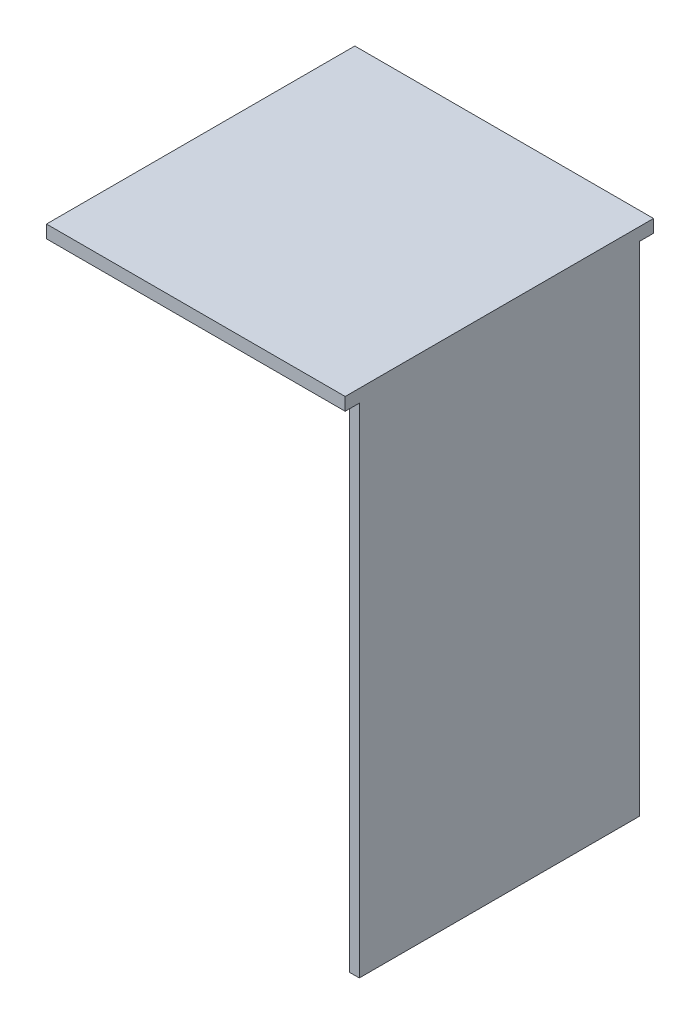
ISO-10303-21;
HEADER;
FILE_DESCRIPTION(('STEP AP214'),'2;1');
FILE_NAME('part.step','',(''),(''),'','','');
FILE_SCHEMA(('AUTOMOTIVE_DESIGN { 1 0 10303 214 1 1 1 1 }'));
ENDSEC;
DATA;
#1=APPLICATION_CONTEXT('core data for automotive mechanical design processes');
#2=APPLICATION_PROTOCOL_DEFINITION('international standard','automotive_design',2000,#1);
#3=PRODUCT_CONTEXT('',#1,'mechanical');
#4=PRODUCT('Part','Part','',(#3));
#5=PRODUCT_RELATED_PRODUCT_CATEGORY('part','',(#4));
#6=PRODUCT_DEFINITION_FORMATION('','',#4);
#7=PRODUCT_DEFINITION_CONTEXT('part definition',#1,'design');
#8=PRODUCT_DEFINITION('design','',#6,#7);
#9=PRODUCT_DEFINITION_SHAPE('','',#8);
#10=(LENGTH_UNIT() NAMED_UNIT(*) SI_UNIT(.MILLI.,.METRE.));
#11=(NAMED_UNIT(*) PLANE_ANGLE_UNIT() SI_UNIT($,.RADIAN.));
#12=(NAMED_UNIT(*) SI_UNIT($,.STERADIAN.) SOLID_ANGLE_UNIT());
#13=UNCERTAINTY_MEASURE_WITH_UNIT(LENGTH_MEASURE(1.E-05),#10,'distance_accuracy_value','');
#14=(GEOMETRIC_REPRESENTATION_CONTEXT(3) GLOBAL_UNCERTAINTY_ASSIGNED_CONTEXT((#13)) GLOBAL_UNIT_ASSIGNED_CONTEXT((#10,
#11,#12)) REPRESENTATION_CONTEXT('',''));
#15=CARTESIAN_POINT('',(0.,0.,0.));
#16=DIRECTION('',(0.,0.,1.));
#17=DIRECTION('',(1.,0.,0.));
#18=AXIS2_PLACEMENT_3D('',#15,#16,#17);
#19=CARTESIAN_POINT('',(-24.,2.,-24.));
#20=DIRECTION('',(0.,0.,1.));
#21=DIRECTION('',(1.,0.,0.));
#22=AXIS2_PLACEMENT_3D('',#19,#20,#21);
#23=PLANE('',#22);
#24=DIRECTION('',(-1.,0.,0.));
#25=VECTOR('',#24,1.);
#26=CARTESIAN_POINT('',(-24.,2.,-24.));
#27=LINE('',#26,#25);
#28=CARTESIAN_POINT('',(22.5,2.00000000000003,-24.));
#29=VERTEX_POINT('',#28);
#30=CARTESIAN_POINT('',(-24.,2.,-24.));
#31=VERTEX_POINT('',#30);
#32=EDGE_CURVE('E93',#29,#31,#27,.T.);
#33=ORIENTED_EDGE('',*,*,#32,.F.);
#34=DIRECTION('',(0.,-1.,0.));
#35=VECTOR('',#34,1.);
#36=CARTESIAN_POINT('',(22.5,79.5,-24.));
#37=LINE('',#36,#35);
#38=CARTESIAN_POINT('',(22.5,0.,-24.));
#39=VERTEX_POINT('',#38);
#40=EDGE_CURVE('E137',#29,#39,#37,.T.);
#41=ORIENTED_EDGE('',*,*,#40,.T.);
#42=DIRECTION('',(-1.,0.,0.));
#43=VECTOR('',#42,1.);
#44=CARTESIAN_POINT('',(-24.,0.,-24.));
#45=LINE('',#44,#43);
#46=CARTESIAN_POINT('',(-24.,0.,-24.));
#47=VERTEX_POINT('',#46);
#48=EDGE_CURVE('E80',#39,#47,#45,.T.);
#49=ORIENTED_EDGE('',*,*,#48,.T.);
#50=DIRECTION('',(0.,-1.,0.));
#51=VECTOR('',#50,1.);
#52=CARTESIAN_POINT('',(-24.,2.,-24.));
#53=LINE('',#52,#51);
#54=EDGE_CURVE('E75',#31,#47,#53,.T.);
#55=ORIENTED_EDGE('',*,*,#54,.F.);
#56=EDGE_LOOP('',(#33,#41,#49,#55));
#57=FACE_BOUND('',#56,.T.);
#58=ADVANCED_FACE('F33',(#57),#23,.F.);
#59=CARTESIAN_POINT('',(-24.,2.,-24.));
#60=DIRECTION('',(1.,0.,0.));
#61=DIRECTION('',(0.,0.,-1.));
#62=AXIS2_PLACEMENT_3D('',#59,#60,#61);
#63=PLANE('',#62);
#64=DIRECTION('',(0.,0.,1.));
#65=VECTOR('',#64,1.);
#66=CARTESIAN_POINT('',(-24.,0.,-24.));
#67=LINE('',#66,#65);
#68=CARTESIAN_POINT('',(-24.,0.,24.));
#69=VERTEX_POINT('',#68);
#70=EDGE_CURVE('E69',#47,#69,#67,.T.);
#71=ORIENTED_EDGE('',*,*,#70,.T.);
#72=DIRECTION('',(0.,-1.,0.));
#73=VECTOR('',#72,1.);
#74=CARTESIAN_POINT('',(-24.,2.,24.));
#75=LINE('',#74,#73);
#76=CARTESIAN_POINT('',(-24.,2.,24.));
#77=VERTEX_POINT('',#76);
#78=EDGE_CURVE('E72',#77,#69,#75,.T.);
#79=ORIENTED_EDGE('',*,*,#78,.F.);
#80=DIRECTION('',(0.,0.,1.));
#81=VECTOR('',#80,1.);
#82=CARTESIAN_POINT('',(-24.,2.,-24.));
#83=LINE('',#82,#81);
#84=EDGE_CURVE('E56',#31,#77,#83,.T.);
#85=ORIENTED_EDGE('',*,*,#84,.F.);
#86=ORIENTED_EDGE('',*,*,#54,.T.);
#87=EDGE_LOOP('',(#71,#79,#85,#86));
#88=FACE_BOUND('',#87,.T.);
#89=ADVANCED_FACE('F71',(#88),#63,.F.);
#90=CARTESIAN_POINT('',(-24.,2.,24.));
#91=DIRECTION('',(0.,0.,-1.));
#92=DIRECTION('',(-1.,0.,0.));
#93=AXIS2_PLACEMENT_3D('',#90,#91,#92);
#94=PLANE('',#93);
#95=DIRECTION('',(1.,0.,0.));
#96=VECTOR('',#95,1.);
#97=CARTESIAN_POINT('',(-24.,0.,24.));
#98=LINE('',#97,#96);
#99=CARTESIAN_POINT('',(22.5,0.,24.));
#100=VERTEX_POINT('',#99);
#101=EDGE_CURVE('E79',#69,#100,#98,.T.);
#102=ORIENTED_EDGE('',*,*,#101,.T.);
#103=DIRECTION('',(0.,-1.,0.));
#104=VECTOR('',#103,1.);
#105=CARTESIAN_POINT('',(22.5,79.5,24.));
#106=LINE('',#105,#104);
#107=CARTESIAN_POINT('',(22.5,2.00000000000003,24.));
#108=VERTEX_POINT('',#107);
#109=EDGE_CURVE('E161',#108,#100,#106,.T.);
#110=ORIENTED_EDGE('',*,*,#109,.F.);
#111=DIRECTION('',(1.,0.,0.));
#112=VECTOR('',#111,1.);
#113=CARTESIAN_POINT('',(-24.,2.,24.));
#114=LINE('',#113,#112);
#115=EDGE_CURVE('E87',#77,#108,#114,.T.);
#116=ORIENTED_EDGE('',*,*,#115,.F.);
#117=ORIENTED_EDGE('',*,*,#78,.T.);
#118=EDGE_LOOP('',(#102,#110,#116,#117));
#119=FACE_BOUND('',#118,.T.);
#120=ADVANCED_FACE('F84',(#119),#94,.F.);
#121=CARTESIAN_POINT('',(0.,2.,0.));
#122=DIRECTION('',(0.,1.,0.));
#123=DIRECTION('',(0.,0.,1.));
#124=AXIS2_PLACEMENT_3D('',#121,#122,#123);
#125=PLANE('',#124);
#126=DIRECTION('',(0.,0.,1.));
#127=VECTOR('',#126,1.);
#128=CARTESIAN_POINT('',(22.5,2.,0.));
#129=LINE('',#128,#127);
#130=EDGE_CURVE('E171',#29,#108,#129,.T.);
#131=ORIENTED_EDGE('',*,*,#130,.F.);
#132=ORIENTED_EDGE('',*,*,#32,.T.);
#133=ORIENTED_EDGE('',*,*,#84,.T.);
#134=ORIENTED_EDGE('',*,*,#115,.T.);
#135=EDGE_LOOP('',(#131,#132,#133,#134));
#136=FACE_BOUND('',#135,.T.);
#137=ADVANCED_FACE('F175',(#136),#125,.T.);
#138=CARTESIAN_POINT('',(0.,0.,0.));
#139=DIRECTION('',(0.,1.,0.));
#140=DIRECTION('',(0.,0.,1.));
#141=AXIS2_PLACEMENT_3D('',#138,#139,#140);
#142=PLANE('',#141);
#143=ORIENTED_EDGE('',*,*,#48,.F.);
#144=DIRECTION('',(0.,0.,-1.));
#145=VECTOR('',#144,1.);
#146=CARTESIAN_POINT('',(22.5,0.,-24.));
#147=LINE('',#146,#145);
#148=CARTESIAN_POINT('',(22.5,0.,-21.8));
#149=VERTEX_POINT('',#148);
#150=EDGE_CURVE('E140',#149,#39,#147,.T.);
#151=ORIENTED_EDGE('',*,*,#150,.F.);
#152=DIRECTION('',(-1.,0.,0.));
#153=VECTOR('',#152,1.);
#154=CARTESIAN_POINT('',(0.,0.,-21.8));
#155=LINE('',#154,#153);
#156=CARTESIAN_POINT('',(21.,0.,-21.8));
#157=VERTEX_POINT('',#156);
#158=EDGE_CURVE('E99',#149,#157,#155,.T.);
#159=ORIENTED_EDGE('',*,*,#158,.T.);
#160=DIRECTION('',(0.,0.,1.));
#161=VECTOR('',#160,1.);
#162=CARTESIAN_POINT('',(21.,0.,0.));
#163=LINE('',#162,#161);
#164=CARTESIAN_POINT('',(21.,0.,21.8));
#165=VERTEX_POINT('',#164);
#166=EDGE_CURVE('E40',#157,#165,#163,.T.);
#167=ORIENTED_EDGE('',*,*,#166,.T.);
#168=DIRECTION('',(1.,0.,0.));
#169=VECTOR('',#168,1.);
#170=CARTESIAN_POINT('',(0.,0.,21.7999999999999));
#171=LINE('',#170,#169);
#172=CARTESIAN_POINT('',(22.5,0.,21.8));
#173=VERTEX_POINT('',#172);
#174=EDGE_CURVE('E11',#165,#173,#171,.T.);
#175=ORIENTED_EDGE('',*,*,#174,.T.);
#176=EDGE_CURVE('E92',#100,#173,#147,.T.);
#177=ORIENTED_EDGE('',*,*,#176,.F.);
#178=ORIENTED_EDGE('',*,*,#101,.F.);
#179=ORIENTED_EDGE('',*,*,#70,.F.);
#180=EDGE_LOOP('',(#143,#151,#159,#167,#175,#177,#178,#179));
#181=FACE_BOUND('',#180,.T.);
#182=ADVANCED_FACE('F90',(#181),#142,.F.);
#183=CARTESIAN_POINT('',(22.5,-77.5,-21.8));
#184=DIRECTION('',(1.,0.,0.));
#185=DIRECTION('',(0.,0.,-1.));
#186=AXIS2_PLACEMENT_3D('',#183,#184,#185);
#187=PLANE('',#186);
#188=DIRECTION('',(0.,1.,0.));
#189=VECTOR('',#188,1.);
#190=CARTESIAN_POINT('',(22.5,-77.5,-21.8));
#191=LINE('',#190,#189);
#192=CARTESIAN_POINT('',(22.5,-77.5,-21.8));
#193=VERTEX_POINT('',#192);
#194=EDGE_CURVE('E124',#193,#149,#191,.T.);
#195=ORIENTED_EDGE('',*,*,#194,.T.);
#196=ORIENTED_EDGE('',*,*,#150,.T.);
#197=ORIENTED_EDGE('',*,*,#40,.F.);
#198=ORIENTED_EDGE('',*,*,#130,.T.);
#199=ORIENTED_EDGE('',*,*,#109,.T.);
#200=ORIENTED_EDGE('',*,*,#176,.T.);
#201=DIRECTION('',(0.,1.,0.));
#202=VECTOR('',#201,1.);
#203=CARTESIAN_POINT('',(22.5,-77.5,21.8));
#204=LINE('',#203,#202);
#205=CARTESIAN_POINT('',(22.5,-77.5,21.8));
#206=VERTEX_POINT('',#205);
#207=EDGE_CURVE('E120',#206,#173,#204,.T.);
#208=ORIENTED_EDGE('',*,*,#207,.F.);
#209=DIRECTION('',(0.,0.,-1.));
#210=VECTOR('',#209,1.);
#211=CARTESIAN_POINT('',(22.5,-77.5,-21.8));
#212=LINE('',#211,#210);
#213=EDGE_CURVE('E169',#206,#193,#212,.T.);
#214=ORIENTED_EDGE('',*,*,#213,.T.);
#215=EDGE_LOOP('',(#195,#196,#197,#198,#199,#200,#208,#214));
#216=FACE_BOUND('',#215,.T.);
#217=ADVANCED_FACE('F158',(#216),#187,.T.);
#218=CARTESIAN_POINT('',(21.,-77.5,21.8));
#219=DIRECTION('',(0.,0.,1.));
#220=DIRECTION('',(1.,0.,0.));
#221=AXIS2_PLACEMENT_3D('',#218,#219,#220);
#222=PLANE('',#221);
#223=ORIENTED_EDGE('',*,*,#174,.F.);
#224=DIRECTION('',(0.,1.,0.));
#225=VECTOR('',#224,1.);
#226=CARTESIAN_POINT('',(21.,-77.5,21.8));
#227=LINE('',#226,#225);
#228=CARTESIAN_POINT('',(21.,-77.5,21.8));
#229=VERTEX_POINT('',#228);
#230=EDGE_CURVE('E114',#229,#165,#227,.T.);
#231=ORIENTED_EDGE('',*,*,#230,.F.);
#232=DIRECTION('',(1.,0.,0.));
#233=VECTOR('',#232,1.);
#234=CARTESIAN_POINT('',(21.,-77.5,21.8));
#235=LINE('',#234,#233);
#236=EDGE_CURVE('E129',#229,#206,#235,.T.);
#237=ORIENTED_EDGE('',*,*,#236,.T.);
#238=ORIENTED_EDGE('',*,*,#207,.T.);
#239=EDGE_LOOP('',(#223,#231,#237,#238));
#240=FACE_BOUND('',#239,.T.);
#241=ADVANCED_FACE('F163',(#240),#222,.T.);
#242=CARTESIAN_POINT('',(21.,-77.5,-21.8));
#243=DIRECTION('',(-1.,0.,0.));
#244=DIRECTION('',(0.,0.,1.));
#245=AXIS2_PLACEMENT_3D('',#242,#243,#244);
#246=PLANE('',#245);
#247=ORIENTED_EDGE('',*,*,#166,.F.);
#248=DIRECTION('',(0.,1.,0.));
#249=VECTOR('',#248,1.);
#250=CARTESIAN_POINT('',(21.,-77.5,-21.8));
#251=LINE('',#250,#249);
#252=CARTESIAN_POINT('',(21.,-77.5,-21.8));
#253=VERTEX_POINT('',#252);
#254=EDGE_CURVE('E47',#253,#157,#251,.T.);
#255=ORIENTED_EDGE('',*,*,#254,.F.);
#256=DIRECTION('',(0.,0.,1.));
#257=VECTOR('',#256,1.);
#258=CARTESIAN_POINT('',(21.,-77.5,-21.8));
#259=LINE('',#258,#257);
#260=EDGE_CURVE('E116',#253,#229,#259,.T.);
#261=ORIENTED_EDGE('',*,*,#260,.T.);
#262=ORIENTED_EDGE('',*,*,#230,.T.);
#263=EDGE_LOOP('',(#247,#255,#261,#262));
#264=FACE_BOUND('',#263,.T.);
#265=ADVANCED_FACE('F109',(#264),#246,.T.);
#266=CARTESIAN_POINT('',(21.,-77.5,-21.8));
#267=DIRECTION('',(0.,0.,-1.));
#268=DIRECTION('',(-1.,0.,0.));
#269=AXIS2_PLACEMENT_3D('',#266,#267,#268);
#270=PLANE('',#269);
#271=ORIENTED_EDGE('',*,*,#158,.F.);
#272=ORIENTED_EDGE('',*,*,#194,.F.);
#273=DIRECTION('',(-1.,0.,0.));
#274=VECTOR('',#273,1.);
#275=CARTESIAN_POINT('',(21.,-77.5,-21.8));
#276=LINE('',#275,#274);
#277=EDGE_CURVE('E165',#193,#253,#276,.T.);
#278=ORIENTED_EDGE('',*,*,#277,.T.);
#279=ORIENTED_EDGE('',*,*,#254,.T.);
#280=EDGE_LOOP('',(#271,#272,#278,#279));
#281=FACE_BOUND('',#280,.T.);
#282=ADVANCED_FACE('F233',(#281),#270,.T.);
#283=CARTESIAN_POINT('',(0.,-77.5,0.));
#284=DIRECTION('',(0.,1.,0.));
#285=DIRECTION('',(0.,0.,1.));
#286=AXIS2_PLACEMENT_3D('',#283,#284,#285);
#287=PLANE('',#286);
#288=ORIENTED_EDGE('',*,*,#213,.F.);
#289=ORIENTED_EDGE('',*,*,#236,.F.);
#290=ORIENTED_EDGE('',*,*,#260,.F.);
#291=ORIENTED_EDGE('',*,*,#277,.F.);
#292=EDGE_LOOP('',(#288,#289,#290,#291));
#293=FACE_BOUND('',#292,.T.);
#294=ADVANCED_FACE('F237',(#293),#287,.F.);
#295=CLOSED_SHELL('',(#58,#89,#120,#137,#182,#217,#241,#265,#282,#294));
#296=MANIFOLD_SOLID_BREP('B2',#295);
#297=ADVANCED_BREP_SHAPE_REPRESENTATION('',(#18,#296),#14);
#298=SHAPE_DEFINITION_REPRESENTATION(#9,#297);
ENDSEC;
END-ISO-10303-21;
